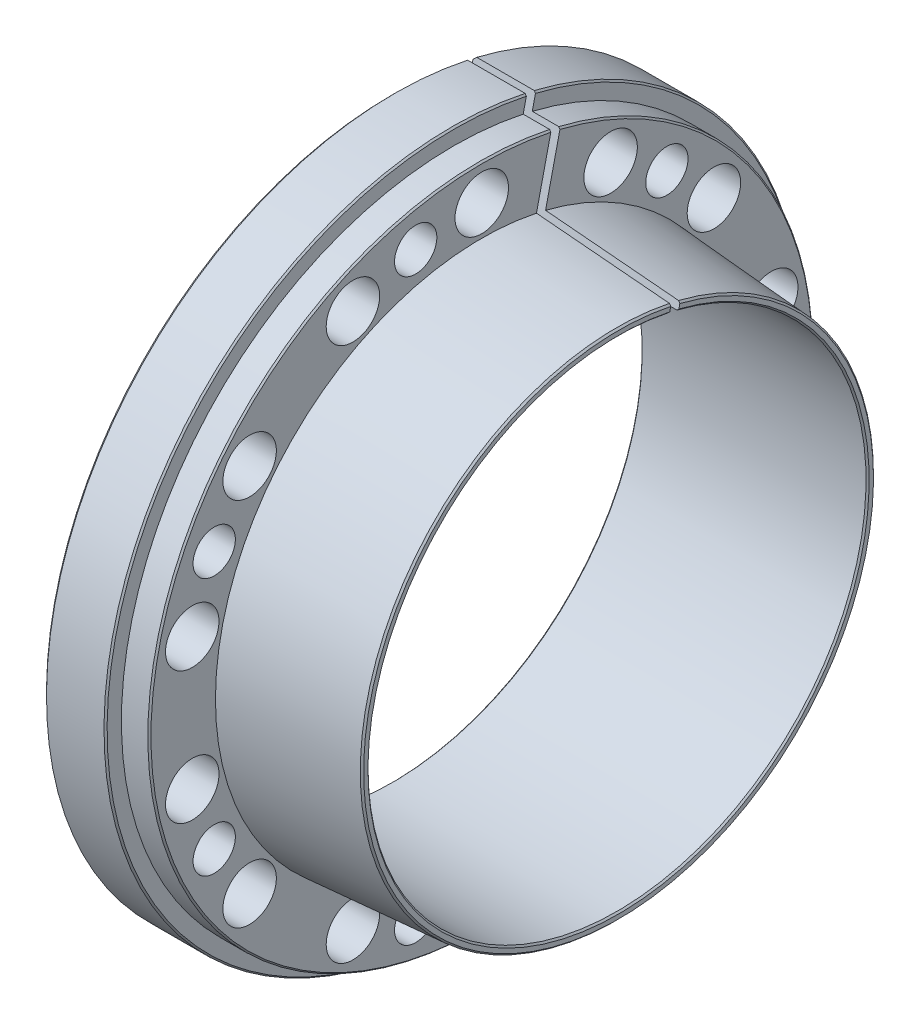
from build123d import *
from OCP.BRepFilletAPI import BRepFilletAPI_MakeChamfer

# Parameters (mm, degrees)
CHAMFER_1_SIZE             = 0.25
CHAMFER_1_SIZE2            = 0.269994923
CHAMFER_2_SIZE             = 0.25
CHAMFER_3_SIZE             = 0.5
SKETCH_2_R                 = 4.3
CUT_EXTRUDE_1_DEPTH        = 88.202350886
PATTERN_CIRCULAR_1_COUNT   = 14
HOLE_WIZARD_1_D            = 6.8
PATTERN_CIRCULAR_2_COUNT   = 7
CUT_EXTRUDE_1_2_DEPTH      = 88.202350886
CUT_EXTRUDE_1_2_DEPTH_BACK = 88.202350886


with BuildPart() as part:
    # Sketch 1 → Revolve 1 (revolve)
    with BuildSketch(Plane.XY, mode=Mode.PRIVATE) as revolve_1_sk:
        Polygon((0, 56), (10, 56), (10, 53.45), (14.5, 53.45), (14.5, 42.8275), (36.5, 41.250520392), (36.5, 40.05), (0, 40.05), align=None)
    revolve(revolve_1_sk.sketch.rotate(Axis((0, 0, 0), (1, 0, 0)), 90), axis=Axis((0, 0, 0), (1, 0, 0)))

    # Chamfer 1: one chamfer whose edges measure the first distance from different faces: ONE call of the kernel's chamfer builder (chamfer() names one face for all edges)
    chamfer_1_edges_1 = [part.edges().sort_by_distance(p)[0] for p in [
        (36.5, 0, -40.05),
        (14.5, 0, -53.45),
        (10, 0, -56),
    ]]
    chamfer_1_edges_2 = [part.edges().sort_by_distance(p)[0] for p in [
        (36.5, 0, -41.250520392),
    ]]
    chamfer_1_side_2 = [part.faces().sort_by_distance(p)[0] for p in [
        (36.5, 0, -40.083779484),
    ]]
    chamfer_1 = BRepFilletAPI_MakeChamfer(part.part.solid().wrapped)
    for e in chamfer_1_edges_1:
        chamfer_1.Add(CHAMFER_1_SIZE, e.wrapped)
    for e in chamfer_1_edges_2:
        chamfer_1.Add(CHAMFER_1_SIZE, CHAMFER_1_SIZE2, e.wrapped, chamfer_1_side_2[0].wrapped)  # the first distance lies on this face
    add(Compound.cast(chamfer_1.Shape()), mode=Mode.REPLACE)

    # Chamfer 2
    chamfer_2_edges = [part.edges().sort_by_distance(p)[0] for p in [
        (0, 0, -40.05),
    ]]
    chamfer(chamfer_2_edges, length=CHAMFER_2_SIZE)

    # Chamfer 3
    chamfer_3_edges = [part.edges().sort_by_distance(p)[0] for p in [
        (0, 0, -56),
    ]]
    chamfer(chamfer_3_edges, length=CHAMFER_3_SIZE)

    # Sketch 2 → Cut-Extrude 1 (cut, through all)
    with BuildSketch(Plane.ZY):
        with Locations((0, 47.75)):
            Circle(SKETCH_2_R)
    cut_extrude_1 = extrude(amount=-CUT_EXTRUDE_1_DEPTH, mode=Mode.SUBTRACT)

    # Pattern Circular 1: Cut-Extrude 1 ×14 about axis
    pattern_circular_1_axis = Axis((0, 0, 0), (1, 0, 0))
    for i in range(1, PATTERN_CIRCULAR_1_COUNT):
        add(cut_extrude_1.rotate(pattern_circular_1_axis, i * 360 / PATTERN_CIRCULAR_1_COUNT), mode=Mode.SUBTRACT)

    # Hole Wizard 1 (through all)
    with Locations(Plane.ZY):
        with Locations((10.625339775, 46.552815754)):
            hole_wizard_1 = Hole(HOLE_WIZARD_1_D / 2)

    # Pattern Circular 2: Hole Wizard 1 ×7 about axis
    pattern_circular_2_axis = Axis((0, -6.947e-06, -0.000108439), (1, 0, 0))
    for i in range(1, PATTERN_CIRCULAR_2_COUNT):
        add(hole_wizard_1.rotate(pattern_circular_2_axis, i * 360 / PATTERN_CIRCULAR_2_COUNT), mode=Mode.SUBTRACT)

    # Sketch 5 → Cut-Extrude 1 2 (cut, two sides: drawn at the far end of the back side and taken through both)
    with BuildSketch(Plane.ZY.offset(-CUT_EXTRUDE_1_2_DEPTH_BACK)):
        Polygon((0.731196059, 0.166890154), (-11.729935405, 54.762862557), (-13.192327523, 54.42908225), (-0.731196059, -0.166890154), align=None)
    extrude(amount=CUT_EXTRUDE_1_2_DEPTH + CUT_EXTRUDE_1_2_DEPTH_BACK, mode=Mode.SUBTRACT)


solid = part.part
